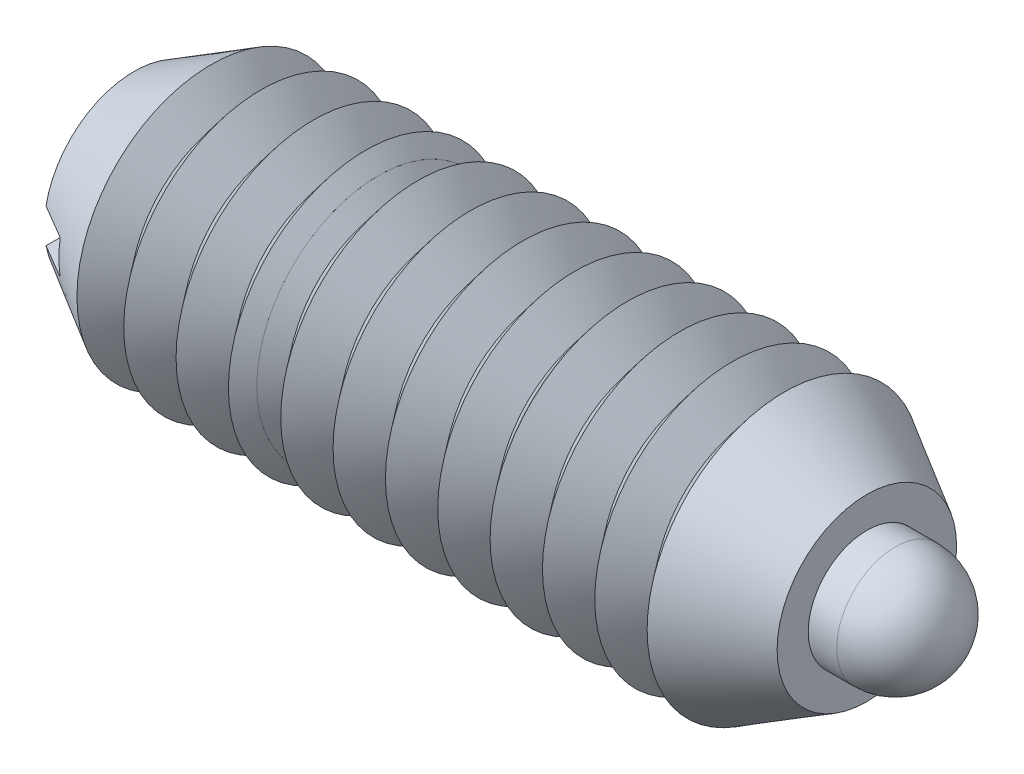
ISO-10303-21;
HEADER;
FILE_DESCRIPTION(('STEP AP214'),'2;1');
FILE_NAME('part.step','',(''),(''),'','','');
FILE_SCHEMA(('AUTOMOTIVE_DESIGN { 1 0 10303 214 1 1 1 1 }'));
ENDSEC;
DATA;
#1=APPLICATION_CONTEXT('core data for automotive mechanical design processes');
#2=APPLICATION_PROTOCOL_DEFINITION('international standard','automotive_design',2000,#1);
#3=PRODUCT_CONTEXT('',#1,'mechanical');
#4=PRODUCT('Part','Part','',(#3));
#5=PRODUCT_RELATED_PRODUCT_CATEGORY('part','',(#4));
#6=PRODUCT_DEFINITION_FORMATION('','',#4);
#7=PRODUCT_DEFINITION_CONTEXT('part definition',#1,'design');
#8=PRODUCT_DEFINITION('design','',#6,#7);
#9=PRODUCT_DEFINITION_SHAPE('','',#8);
#10=(LENGTH_UNIT() NAMED_UNIT(*) SI_UNIT(.MILLI.,.METRE.));
#11=(NAMED_UNIT(*) PLANE_ANGLE_UNIT() SI_UNIT($,.RADIAN.));
#12=(NAMED_UNIT(*) SI_UNIT($,.STERADIAN.) SOLID_ANGLE_UNIT());
#13=UNCERTAINTY_MEASURE_WITH_UNIT(LENGTH_MEASURE(1.E-05),#10,'distance_accuracy_value','');
#14=(GEOMETRIC_REPRESENTATION_CONTEXT(3) GLOBAL_UNCERTAINTY_ASSIGNED_CONTEXT((#13)) GLOBAL_UNIT_ASSIGNED_CONTEXT((#10,
#11,#12)) REPRESENTATION_CONTEXT('',''));
#15=CARTESIAN_POINT('',(0.,0.,0.));
#16=DIRECTION('',(0.,0.,1.));
#17=DIRECTION('',(1.,0.,0.));
#18=AXIS2_PLACEMENT_3D('',#15,#16,#17);
#19=CARTESIAN_POINT('',(9.0678,0.,0.));
#20=DIRECTION('',(-1.,0.,0.));
#21=DIRECTION('',(0.,-0.719424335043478,-0.694570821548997));
#22=AXIS2_PLACEMENT_3D('',#19,#20,#21);
#23=PLANE('',#22);
#24=CARTESIAN_POINT('',(9.0678,0.,0.));
#25=DIRECTION('',(1.,0.,0.));
#26=DIRECTION('',(0.,0.719424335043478,0.694570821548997));
#27=AXIS2_PLACEMENT_3D('',#24,#25,#26);
#28=CIRCLE('',#27,0.889);
#29=CARTESIAN_POINT('',(9.0678,0.639568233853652,0.617473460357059));
#30=VERTEX_POINT('',#29);
#31=EDGE_CURVE('P0_E10',#30,#30,#28,.T.);
#32=ORIENTED_EDGE('',*,*,#31,.F.);
#33=EDGE_LOOP('',(#32));
#34=FACE_BOUND('',#33,.T.);
#35=ADVANCED_FACE('P0_F14',(#34),#23,.T.);
#36=CARTESIAN_POINT('',(9.2456,0.,0.));
#37=DIRECTION('',(1.,0.,0.));
#38=DIRECTION('',(0.,0.719424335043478,0.694570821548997));
#39=AXIS2_PLACEMENT_3D('',#36,#37,#38);
#40=CONICAL_SURFACE('',#39,1.0668,0.78539816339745);
#41=ORIENTED_EDGE('',*,*,#31,.T.);
#42=EDGE_LOOP('',(#41));
#43=FACE_BOUND('',#42,.T.);
#44=CARTESIAN_POINT('',(9.2456,0.,0.));
#45=DIRECTION('',(1.,0.,0.));
#46=DIRECTION('',(0.,0.719424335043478,0.694570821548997));
#47=AXIS2_PLACEMENT_3D('',#44,#45,#46);
#48=CIRCLE('',#47,1.0668);
#49=CARTESIAN_POINT('',(9.2456,0.767481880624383,0.740968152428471));
#50=VERTEX_POINT('',#49);
#51=EDGE_CURVE('P0_E20',#50,#50,#48,.T.);
#52=ORIENTED_EDGE('',*,*,#51,.F.);
#53=EDGE_LOOP('',(#52));
#54=FACE_BOUND('',#53,.T.);
#55=ADVANCED_FACE('P0_F54',(#43,#54),#40,.T.);
#56=CARTESIAN_POINT('',(12.4333,0.,0.));
#57=DIRECTION('',(1.,0.,0.));
#58=DIRECTION('',(0.,0.719424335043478,0.694570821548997));
#59=AXIS2_PLACEMENT_3D('',#56,#57,#58);
#60=CYLINDRICAL_SURFACE('',#59,1.0668);
#61=ORIENTED_EDGE('',*,*,#51,.T.);
#62=EDGE_LOOP('',(#61));
#63=FACE_BOUND('',#62,.T.);
#64=CARTESIAN_POINT('',(10.5378413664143,0.,0.));
#65=DIRECTION('',(1.,0.,0.));
#66=DIRECTION('',(0.,0.719424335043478,0.694570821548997));
#67=AXIS2_PLACEMENT_3D('',#64,#65,#66);
#68=CIRCLE('',#67,1.0668);
#69=CARTESIAN_POINT('',(10.5378413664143,0.767481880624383,0.74096815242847));
#70=VERTEX_POINT('',#69);
#71=EDGE_CURVE('P0_E24',#70,#70,#68,.T.);
#72=ORIENTED_EDGE('',*,*,#71,.F.);
#73=EDGE_LOOP('',(#72));
#74=FACE_BOUND('',#73,.T.);
#75=ADVANCED_FACE('P0_F50',(#63,#74),#60,.T.);
#76=CARTESIAN_POINT('',(10.8458,0.,0.));
#77=DIRECTION('',(-1.,0.,0.));
#78=DIRECTION('',(0.,-0.719424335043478,-0.694570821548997));
#79=AXIS2_PLACEMENT_3D('',#76,#77,#78);
#80=CONICAL_SURFACE('',#79,0.889,0.523598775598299);
#81=ORIENTED_EDGE('',*,*,#71,.T.);
#82=EDGE_LOOP('',(#81));
#83=FACE_BOUND('',#82,.T.);
#84=CARTESIAN_POINT('',(10.8458,0.,0.));
#85=DIRECTION('',(1.,0.,0.));
#86=DIRECTION('',(0.,0.719424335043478,0.694570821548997));
#87=AXIS2_PLACEMENT_3D('',#84,#85,#86);
#88=CIRCLE('',#87,0.889);
#89=CARTESIAN_POINT('',(10.8458,0.639568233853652,0.617473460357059));
#90=VERTEX_POINT('',#89);
#91=EDGE_CURVE('P0_E28',#90,#90,#88,.T.);
#92=ORIENTED_EDGE('',*,*,#91,.F.);
#93=EDGE_LOOP('',(#92));
#94=FACE_BOUND('',#93,.T.);
#95=ADVANCED_FACE('P0_F41',(#83,#94),#80,.T.);
#96=CARTESIAN_POINT('',(12.4333,0.,0.));
#97=DIRECTION('',(1.,0.,0.));
#98=DIRECTION('',(0.,0.719424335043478,0.694570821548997));
#99=AXIS2_PLACEMENT_3D('',#96,#97,#98);
#100=CYLINDRICAL_SURFACE('',#99,0.889);
#101=ORIENTED_EDGE('',*,*,#91,.T.);
#102=EDGE_LOOP('',(#101));
#103=FACE_BOUND('',#102,.T.);
#104=CARTESIAN_POINT('',(11.5443,0.,0.));
#105=DIRECTION('',(1.,0.,0.));
#106=DIRECTION('',(0.,0.719424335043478,0.694570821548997));
#107=AXIS2_PLACEMENT_3D('',#104,#105,#106);
#108=CIRCLE('',#107,0.889);
#109=CARTESIAN_POINT('',(11.5443,0.639568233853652,0.617473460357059));
#110=VERTEX_POINT('',#109);
#111=EDGE_CURVE('P0_E33',#110,#110,#108,.T.);
#112=ORIENTED_EDGE('',*,*,#111,.F.);
#113=EDGE_LOOP('',(#112));
#114=FACE_BOUND('',#113,.T.);
#115=ADVANCED_FACE('P0_F39',(#103,#114),#100,.T.);
#116=CARTESIAN_POINT('',(11.5443,0.,0.));
#117=DIRECTION('',(1.,0.,0.));
#118=DIRECTION('',(0.,-0.719424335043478,-0.694570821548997));
#119=AXIS2_PLACEMENT_3D('',#116,#117,#118);
#120=SPHERICAL_SURFACE('',#119,0.889);
#121=ORIENTED_EDGE('',*,*,#111,.T.);
#122=EDGE_LOOP('',(#121));
#123=FACE_BOUND('',#122,.T.);
#124=ADVANCED_FACE('P0_F37',(#123),#120,.T.);
#125=CLOSED_SHELL('',(#35,#55,#75,#95,#115,#124));
#126=MANIFOLD_SOLID_BREP('P0_B1',#125);
#127=CARTESIAN_POINT('',(3.70416666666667,4.1656,-2.0828));
#128=DIRECTION('',(-1.,0.,0.));
#129=DIRECTION('',(0.,-1.,0.));
#130=AXIS2_PLACEMENT_3D('',#127,#128,#129);
#131=PLANE('',#130);
#132=CARTESIAN_POINT('',(3.70416666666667,0.,0.));
#133=DIRECTION('',(-1.,0.,0.));
#134=DIRECTION('',(0.,-1.,0.));
#135=AXIS2_PLACEMENT_3D('',#132,#133,#134);
#136=CIRCLE('',#135,1.84380808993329);
#137=CARTESIAN_POINT('',(3.70416666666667,-1.84380808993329,0.));
#138=VERTEX_POINT('',#137);
#139=EDGE_CURVE('P1_E31',#138,#138,#136,.F.);
#140=ORIENTED_EDGE('',*,*,#139,.F.);
#141=EDGE_LOOP('',(#140));
#142=FACE_BOUND('',#141,.T.);
#143=CARTESIAN_POINT('',(3.70416666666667,0.,0.));
#144=DIRECTION('',(1.,0.,0.));
#145=DIRECTION('',(0.,0.,-1.));
#146=AXIS2_PLACEMENT_3D('',#143,#144,#145);
#147=CIRCLE('',#146,1.0922);
#148=CARTESIAN_POINT('',(3.70416666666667,0.,-1.0922));
#149=VERTEX_POINT('',#148);
#150=EDGE_CURVE('P1_E47',#149,#149,#147,.T.);
#151=ORIENTED_EDGE('',*,*,#150,.T.);
#152=EDGE_LOOP('',(#151));
#153=FACE_BOUND('',#152,.T.);
#154=ADVANCED_FACE('P1_F14',(#142,#153),#131,.T.);
#155=CARTESIAN_POINT('',(7.40833333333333,4.1656,-2.0828));
#156=DIRECTION('',(1.,0.,0.));
#157=DIRECTION('',(0.,1.,0.));
#158=AXIS2_PLACEMENT_3D('',#155,#156,#157);
#159=PLANE('',#158);
#160=CARTESIAN_POINT('',(7.40833333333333,0.,0.));
#161=DIRECTION('',(1.,0.,0.));
#162=DIRECTION('',(0.,1.,0.));
#163=AXIS2_PLACEMENT_3D('',#160,#161,#162);
#164=CIRCLE('',#163,1.99132743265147);
#165=CARTESIAN_POINT('',(7.40833333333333,1.99132743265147,0.));
#166=VERTEX_POINT('',#165);
#167=EDGE_CURVE('P1_E33',#166,#166,#164,.F.);
#168=ORIENTED_EDGE('',*,*,#167,.F.);
#169=EDGE_LOOP('',(#168));
#170=FACE_BOUND('',#169,.T.);
#171=CARTESIAN_POINT('',(7.40833333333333,0.,0.));
#172=DIRECTION('',(1.,0.,0.));
#173=DIRECTION('',(0.,1.,0.));
#174=AXIS2_PLACEMENT_3D('',#171,#172,#173);
#175=CIRCLE('',#174,1.0922);
#176=CARTESIAN_POINT('',(7.40833333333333,1.0922,0.));
#177=VERTEX_POINT('',#176);
#178=EDGE_CURVE('P1_E18',#177,#177,#175,.F.);
#179=ORIENTED_EDGE('',*,*,#178,.T.);
#180=EDGE_LOOP('',(#179));
#181=FACE_BOUND('',#180,.T.);
#182=ADVANCED_FACE('P1_F77',(#170,#181),#159,.T.);
#183=CARTESIAN_POINT('',(5.10031999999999,0.,0.));
#184=DIRECTION('',(-1.,0.,0.));
#185=DIRECTION('',(0.,0.,1.));
#186=AXIS2_PLACEMENT_3D('',#183,#184,#185);
#187=CONICAL_SURFACE('',#186,2.0828,0.895664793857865);
#188=CARTESIAN_POINT('',(5.49719499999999,0.,0.));
#189=DIRECTION('',(-1.,0.,0.));
#190=DIRECTION('',(0.,0.,1.));
#191=AXIS2_PLACEMENT_3D('',#188,#189,#190);
#192=CIRCLE('',#191,1.58710328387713);
#193=CARTESIAN_POINT('',(5.49719499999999,0.,1.58710328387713));
#194=VERTEX_POINT('',#193);
#195=EDGE_CURVE('P1_E57',#194,#194,#192,.T.);
#196=ORIENTED_EDGE('',*,*,#195,.T.);
#197=EDGE_LOOP('',(#196));
#198=FACE_BOUND('',#197,.T.);
#199=CARTESIAN_POINT('',(5.10031999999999,0.,0.));
#200=DIRECTION('',(-1.,0.,0.));
#201=DIRECTION('',(0.,0.,1.));
#202=AXIS2_PLACEMENT_3D('',#199,#200,#201);
#203=CIRCLE('',#202,2.0828);
#204=CARTESIAN_POINT('',(5.10031999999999,0.,2.0828));
#205=VERTEX_POINT('',#204);
#206=EDGE_CURVE('P1_E44',#205,#205,#203,.T.);
#207=ORIENTED_EDGE('',*,*,#206,.F.);
#208=EDGE_LOOP('',(#207));
#209=FACE_BOUND('',#208,.T.);
#210=ADVANCED_FACE('P1_F83',(#198,#209),#187,.T.);
#211=CARTESIAN_POINT('',(4.70344499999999,0.,0.));
#212=DIRECTION('',(1.,0.,0.));
#213=DIRECTION('',(0.,0.,-1.));
#214=AXIS2_PLACEMENT_3D('',#211,#212,#213);
#215=CONICAL_SURFACE('',#214,1.58710328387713,0.895664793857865);
#216=ORIENTED_EDGE('',*,*,#206,.T.);
#217=EDGE_LOOP('',(#216));
#218=FACE_BOUND('',#217,.T.);
#219=CARTESIAN_POINT('',(4.70344499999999,0.,0.));
#220=DIRECTION('',(-1.,0.,0.));
#221=DIRECTION('',(0.,0.,1.));
#222=AXIS2_PLACEMENT_3D('',#219,#220,#221);
#223=CIRCLE('',#222,1.58710328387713);
#224=CARTESIAN_POINT('',(4.70344499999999,0.,1.58710328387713));
#225=VERTEX_POINT('',#224);
#226=EDGE_CURVE('P1_E51',#225,#225,#223,.T.);
#227=ORIENTED_EDGE('',*,*,#226,.F.);
#228=EDGE_LOOP('',(#227));
#229=FACE_BOUND('',#228,.T.);
#230=ADVANCED_FACE('P1_F101',(#218,#229),#215,.T.);
#231=CARTESIAN_POINT('',(4.30657,0.,0.));
#232=DIRECTION('',(-1.,0.,0.));
#233=DIRECTION('',(0.,0.,1.));
#234=AXIS2_PLACEMENT_3D('',#231,#232,#233);
#235=CONICAL_SURFACE('',#234,2.0828,0.895664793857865);
#236=ORIENTED_EDGE('',*,*,#226,.T.);
#237=EDGE_LOOP('',(#236));
#238=FACE_BOUND('',#237,.T.);
#239=CARTESIAN_POINT('',(4.30656999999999,0.,0.));
#240=DIRECTION('',(-1.,0.,0.));
#241=DIRECTION('',(0.,0.,1.));
#242=AXIS2_PLACEMENT_3D('',#239,#240,#241);
#243=CIRCLE('',#242,2.0828);
#244=CARTESIAN_POINT('',(4.30656999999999,0.,2.0828));
#245=VERTEX_POINT('',#244);
#246=EDGE_CURVE('P1_E35',#245,#245,#243,.T.);
#247=ORIENTED_EDGE('',*,*,#246,.F.);
#248=EDGE_LOOP('',(#247));
#249=FACE_BOUND('',#248,.T.);
#250=ADVANCED_FACE('P1_F98',(#238,#249),#235,.T.);
#251=CARTESIAN_POINT('',(3.909695,0.,0.));
#252=DIRECTION('',(1.,0.,0.));
#253=DIRECTION('',(0.,0.,-1.));
#254=AXIS2_PLACEMENT_3D('',#251,#252,#253);
#255=CONICAL_SURFACE('',#254,1.58710328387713,0.895664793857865);
#256=ORIENTED_EDGE('',*,*,#246,.T.);
#257=EDGE_LOOP('',(#256));
#258=FACE_BOUND('',#257,.T.);
#259=CARTESIAN_POINT('',(3.909695,0.,0.));
#260=DIRECTION('',(-1.,0.,0.));
#261=DIRECTION('',(0.,0.,1.));
#262=AXIS2_PLACEMENT_3D('',#259,#260,#261);
#263=CIRCLE('',#262,1.58710328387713);
#264=CARTESIAN_POINT('',(3.909695,0.,1.58710328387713));
#265=VERTEX_POINT('',#264);
#266=EDGE_CURVE('P1_E39',#265,#265,#263,.T.);
#267=ORIENTED_EDGE('',*,*,#266,.F.);
#268=EDGE_LOOP('',(#267));
#269=FACE_BOUND('',#268,.T.);
#270=ADVANCED_FACE('P1_F94',(#258,#269),#255,.T.);
#271=CARTESIAN_POINT('',(3.51282,0.,0.));
#272=DIRECTION('',(-1.,0.,0.));
#273=DIRECTION('',(0.,0.,1.));
#274=AXIS2_PLACEMENT_3D('',#271,#272,#273);
#275=CONICAL_SURFACE('',#274,2.0828,0.895664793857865);
#276=ORIENTED_EDGE('',*,*,#266,.T.);
#277=EDGE_LOOP('',(#276));
#278=FACE_BOUND('',#277,.T.);
#279=ORIENTED_EDGE('',*,*,#139,.T.);
#280=EDGE_LOOP('',(#279));
#281=FACE_BOUND('',#280,.T.);
#282=ADVANCED_FACE('P1_F90',(#278,#281),#275,.T.);
#283=CARTESIAN_POINT('',(5.49719499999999,0.,0.));
#284=DIRECTION('',(1.,0.,0.));
#285=DIRECTION('',(0.,0.,-1.));
#286=AXIS2_PLACEMENT_3D('',#283,#284,#285);
#287=CONICAL_SURFACE('',#286,1.58710328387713,0.895664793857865);
#288=CARTESIAN_POINT('',(5.89406999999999,0.,0.));
#289=DIRECTION('',(-1.,0.,0.));
#290=DIRECTION('',(0.,0.,1.));
#291=AXIS2_PLACEMENT_3D('',#288,#289,#290);
#292=CIRCLE('',#291,2.0828);
#293=CARTESIAN_POINT('',(5.89406999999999,0.,2.0828));
#294=VERTEX_POINT('',#293);
#295=EDGE_CURVE('P1_E54',#294,#294,#292,.T.);
#296=ORIENTED_EDGE('',*,*,#295,.T.);
#297=EDGE_LOOP('',(#296));
#298=FACE_BOUND('',#297,.T.);
#299=ORIENTED_EDGE('',*,*,#195,.F.);
#300=EDGE_LOOP('',(#299));
#301=FACE_BOUND('',#300,.T.);
#302=ADVANCED_FACE('P1_F93',(#298,#301),#287,.T.);
#303=CARTESIAN_POINT('',(5.89406999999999,0.,0.));
#304=DIRECTION('',(-1.,0.,0.));
#305=DIRECTION('',(0.,0.,1.));
#306=AXIS2_PLACEMENT_3D('',#303,#304,#305);
#307=CONICAL_SURFACE('',#306,2.0828,0.895664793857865);
#308=CARTESIAN_POINT('',(6.29094499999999,0.,0.));
#309=DIRECTION('',(-1.,0.,0.));
#310=DIRECTION('',(0.,0.,1.));
#311=AXIS2_PLACEMENT_3D('',#308,#309,#310);
#312=CIRCLE('',#311,1.58710328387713);
#313=CARTESIAN_POINT('',(6.29094499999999,0.,1.58710328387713));
#314=VERTEX_POINT('',#313);
#315=EDGE_CURVE('P1_E22',#314,#314,#312,.T.);
#316=ORIENTED_EDGE('',*,*,#315,.T.);
#317=EDGE_LOOP('',(#316));
#318=FACE_BOUND('',#317,.T.);
#319=ORIENTED_EDGE('',*,*,#295,.F.);
#320=EDGE_LOOP('',(#319));
#321=FACE_BOUND('',#320,.T.);
#322=ADVANCED_FACE('P1_F74',(#318,#321),#307,.T.);
#323=CARTESIAN_POINT('',(6.29094499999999,0.,0.));
#324=DIRECTION('',(1.,0.,0.));
#325=DIRECTION('',(0.,0.,-1.));
#326=AXIS2_PLACEMENT_3D('',#323,#324,#325);
#327=CONICAL_SURFACE('',#326,1.58710328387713,0.895664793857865);
#328=CARTESIAN_POINT('',(6.68781999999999,0.,0.));
#329=DIRECTION('',(-1.,0.,0.));
#330=DIRECTION('',(0.,0.,1.));
#331=AXIS2_PLACEMENT_3D('',#328,#329,#330);
#332=CIRCLE('',#331,2.0828);
#333=CARTESIAN_POINT('',(6.68781999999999,0.,2.0828));
#334=VERTEX_POINT('',#333);
#335=EDGE_CURVE('P1_E27',#334,#334,#332,.T.);
#336=ORIENTED_EDGE('',*,*,#335,.T.);
#337=EDGE_LOOP('',(#336));
#338=FACE_BOUND('',#337,.T.);
#339=ORIENTED_EDGE('',*,*,#315,.F.);
#340=EDGE_LOOP('',(#339));
#341=FACE_BOUND('',#340,.T.);
#342=ADVANCED_FACE('P1_F62',(#338,#341),#327,.T.);
#343=CARTESIAN_POINT('',(6.68781999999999,0.,0.));
#344=DIRECTION('',(-1.,0.,0.));
#345=DIRECTION('',(0.,0.,1.));
#346=AXIS2_PLACEMENT_3D('',#343,#344,#345);
#347=CONICAL_SURFACE('',#346,2.0828,0.895664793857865);
#348=CARTESIAN_POINT('',(7.08469499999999,0.,0.));
#349=DIRECTION('',(-1.,0.,0.));
#350=DIRECTION('',(0.,0.,1.));
#351=AXIS2_PLACEMENT_3D('',#348,#349,#350);
#352=CIRCLE('',#351,1.58710328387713);
#353=CARTESIAN_POINT('',(7.08469499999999,0.,1.58710328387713));
#354=VERTEX_POINT('',#353);
#355=EDGE_CURVE('P1_E10',#354,#354,#352,.T.);
#356=ORIENTED_EDGE('',*,*,#355,.T.);
#357=EDGE_LOOP('',(#356));
#358=FACE_BOUND('',#357,.T.);
#359=ORIENTED_EDGE('',*,*,#335,.F.);
#360=EDGE_LOOP('',(#359));
#361=FACE_BOUND('',#360,.T.);
#362=ADVANCED_FACE('P1_F65',(#358,#361),#347,.T.);
#363=CARTESIAN_POINT('',(7.08469499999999,0.,0.));
#364=DIRECTION('',(1.,0.,0.));
#365=DIRECTION('',(0.,0.,-1.));
#366=AXIS2_PLACEMENT_3D('',#363,#364,#365);
#367=CONICAL_SURFACE('',#366,1.58710328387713,0.895664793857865);
#368=ORIENTED_EDGE('',*,*,#355,.F.);
#369=EDGE_LOOP('',(#368));
#370=FACE_BOUND('',#369,.T.);
#371=ORIENTED_EDGE('',*,*,#167,.T.);
#372=EDGE_LOOP('',(#371));
#373=FACE_BOUND('',#372,.T.);
#374=ADVANCED_FACE('P1_F16',(#370,#373),#367,.T.);
#375=CARTESIAN_POINT('',(11.1125,0.,0.));
#376=DIRECTION('',(-1.,0.,0.));
#377=DIRECTION('',(0.,0.,1.));
#378=AXIS2_PLACEMENT_3D('',#375,#376,#377);
#379=CYLINDRICAL_SURFACE('',#378,1.0922);
#380=ORIENTED_EDGE('',*,*,#178,.F.);
#381=EDGE_LOOP('',(#380));
#382=FACE_BOUND('',#381,.T.);
#383=ORIENTED_EDGE('',*,*,#150,.F.);
#384=EDGE_LOOP('',(#383));
#385=FACE_BOUND('',#384,.T.);
#386=ADVANCED_FACE('P1_F72',(#382,#385),#379,.F.);
#387=CLOSED_SHELL('',(#154,#182,#210,#230,#250,#270,#282,#302,#322,#342,#362,#374,#386));
#388=MANIFOLD_SOLID_BREP('P1_B1',#387);
#389=CARTESIAN_POINT('',(11.1125,0.,0.));
#390=DIRECTION('',(1.,0.,0.));
#391=DIRECTION('',(0.,0.,-1.));
#392=AXIS2_PLACEMENT_3D('',#389,#390,#391);
#393=PLANE('',#392);
#394=CARTESIAN_POINT('',(11.1125,0.,0.));
#395=DIRECTION('',(1.,0.,0.));
#396=DIRECTION('',(0.,0.,-1.));
#397=AXIS2_PLACEMENT_3D('',#394,#395,#396);
#398=CIRCLE('',#397,1.36129691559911);
#399=CARTESIAN_POINT('',(11.1125,0.,-1.36129691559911));
#400=VERTEX_POINT('',#399);
#401=EDGE_CURVE('P2_E79',#400,#400,#398,.T.);
#402=ORIENTED_EDGE('',*,*,#401,.T.);
#403=EDGE_LOOP('',(#402));
#404=FACE_BOUND('',#403,.T.);
#405=CARTESIAN_POINT('',(11.1125,0.,0.));
#406=DIRECTION('',(-1.,0.,0.));
#407=DIRECTION('',(0.,0.,1.));
#408=AXIS2_PLACEMENT_3D('',#405,#406,#407);
#409=CIRCLE('',#408,0.889);
#410=CARTESIAN_POINT('',(11.1125,0.,0.889));
#411=VERTEX_POINT('',#410);
#412=EDGE_CURVE('P2_E66',#411,#411,#409,.T.);
#413=ORIENTED_EDGE('',*,*,#412,.T.);
#414=EDGE_LOOP('',(#413));
#415=FACE_BOUND('',#414,.T.);
#416=ADVANCED_FACE('P2_F15',(#404,#415),#393,.T.);
#417=CARTESIAN_POINT('',(11.1125,0.,0.));
#418=DIRECTION('',(-1.,0.,0.));
#419=DIRECTION('',(0.,0.,1.));
#420=AXIS2_PLACEMENT_3D('',#417,#418,#419);
#421=CONICAL_SURFACE('',#420,1.36129691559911,0.523598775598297);
#422=CARTESIAN_POINT('',(9.86281999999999,0.,0.));
#423=DIRECTION('',(-1.,0.,0.));
#424=DIRECTION('',(0.,0.,1.));
#425=AXIS2_PLACEMENT_3D('',#422,#423,#424);
#426=CIRCLE('',#425,2.0828);
#427=CARTESIAN_POINT('',(9.86281999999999,0.,2.0828));
#428=VERTEX_POINT('',#427);
#429=EDGE_CURVE('P2_E159',#428,#428,#426,.T.);
#430=ORIENTED_EDGE('',*,*,#429,.F.);
#431=EDGE_LOOP('',(#430));
#432=FACE_BOUND('',#431,.T.);
#433=ORIENTED_EDGE('',*,*,#401,.F.);
#434=EDGE_LOOP('',(#433));
#435=FACE_BOUND('',#434,.T.);
#436=ADVANCED_FACE('P2_F17',(#432,#435),#421,.T.);
#437=CARTESIAN_POINT('',(0.,0.,0.));
#438=DIRECTION('',(-1.,0.,0.));
#439=DIRECTION('',(0.,0.,1.));
#440=AXIS2_PLACEMENT_3D('',#437,#438,#439);
#441=CYLINDRICAL_SURFACE('',#440,0.889);
#442=CARTESIAN_POINT('',(10.8458,0.,0.));
#443=DIRECTION('',(-1.,0.,0.));
#444=DIRECTION('',(0.,0.,1.));
#445=AXIS2_PLACEMENT_3D('',#442,#443,#444);
#446=CIRCLE('',#445,0.889);
#447=CARTESIAN_POINT('',(10.8458,0.,0.889));
#448=VERTEX_POINT('',#447);
#449=EDGE_CURVE('P2_E171',#448,#448,#446,.T.);
#450=ORIENTED_EDGE('',*,*,#449,.T.);
#451=EDGE_LOOP('',(#450));
#452=FACE_BOUND('',#451,.T.);
#453=ORIENTED_EDGE('',*,*,#412,.F.);
#454=EDGE_LOOP('',(#453));
#455=FACE_BOUND('',#454,.T.);
#456=ADVANCED_FACE('P2_F194',(#452,#455),#441,.F.);
#457=CARTESIAN_POINT('',(10.8458,0.,0.));
#458=DIRECTION('',(-1.,0.,0.));
#459=DIRECTION('',(0.,0.,1.));
#460=AXIS2_PLACEMENT_3D('',#457,#458,#459);
#461=CONICAL_SURFACE('',#460,0.889,0.78539816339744);
#462=CARTESIAN_POINT('',(10.668,0.,0.));
#463=DIRECTION('',(-1.,0.,0.));
#464=DIRECTION('',(0.,0.,1.));
#465=AXIS2_PLACEMENT_3D('',#462,#463,#464);
#466=CIRCLE('',#465,1.0668);
#467=CARTESIAN_POINT('',(10.668,0.,1.0668));
#468=VERTEX_POINT('',#467);
#469=EDGE_CURVE('P2_E168',#468,#468,#466,.T.);
#470=ORIENTED_EDGE('',*,*,#469,.T.);
#471=EDGE_LOOP('',(#470));
#472=FACE_BOUND('',#471,.T.);
#473=ORIENTED_EDGE('',*,*,#449,.F.);
#474=EDGE_LOOP('',(#473));
#475=FACE_BOUND('',#474,.T.);
#476=ADVANCED_FACE('P2_F201',(#472,#475),#461,.F.);
#477=CARTESIAN_POINT('',(0.,0.,0.));
#478=DIRECTION('',(-1.,0.,0.));
#479=DIRECTION('',(0.,0.,1.));
#480=AXIS2_PLACEMENT_3D('',#477,#478,#479);
#481=CYLINDRICAL_SURFACE('',#480,1.0668);
#482=CARTESIAN_POINT('',(1.5621,0.,0.));
#483=DIRECTION('',(-1.,0.,0.));
#484=DIRECTION('',(0.,0.,1.));
#485=AXIS2_PLACEMENT_3D('',#482,#483,#484);
#486=CIRCLE('',#485,1.0668);
#487=CARTESIAN_POINT('',(1.5621,0.,1.0668));
#488=VERTEX_POINT('',#487);
#489=EDGE_CURVE('P2_E165',#488,#488,#486,.T.);
#490=ORIENTED_EDGE('',*,*,#489,.T.);
#491=EDGE_LOOP('',(#490));
#492=FACE_BOUND('',#491,.T.);
#493=ORIENTED_EDGE('',*,*,#469,.F.);
#494=EDGE_LOOP('',(#493));
#495=FACE_BOUND('',#494,.T.);
#496=ADVANCED_FACE('P2_F206',(#492,#495),#481,.F.);
#497=CARTESIAN_POINT('',(1.5621,0.,0.));
#498=DIRECTION('',(1.,0.,0.));
#499=DIRECTION('',(0.,0.,-1.));
#500=AXIS2_PLACEMENT_3D('',#497,#498,#499);
#501=PLANE('',#500);
#502=ORIENTED_EDGE('',*,*,#489,.F.);
#503=EDGE_LOOP('',(#502));
#504=FACE_BOUND('',#503,.T.);
#505=ADVANCED_FACE('P2_F212',(#504),#501,.T.);
#506=CARTESIAN_POINT('',(9.46594499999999,0.,0.));
#507=DIRECTION('',(1.,0.,0.));
#508=DIRECTION('',(0.,0.,-1.));
#509=AXIS2_PLACEMENT_3D('',#506,#507,#508);
#510=CONICAL_SURFACE('',#509,1.58710328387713,0.895664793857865);
#511=ORIENTED_EDGE('',*,*,#429,.T.);
#512=EDGE_LOOP('',(#511));
#513=FACE_BOUND('',#512,.T.);
#514=CARTESIAN_POINT('',(9.46594499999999,0.,0.));
#515=DIRECTION('',(-1.,0.,0.));
#516=DIRECTION('',(0.,0.,1.));
#517=AXIS2_PLACEMENT_3D('',#514,#515,#516);
#518=CIRCLE('',#517,1.58710328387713);
#519=CARTESIAN_POINT('',(9.46594499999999,0.,1.58710328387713));
#520=VERTEX_POINT('',#519);
#521=EDGE_CURVE('P2_E162',#520,#520,#518,.T.);
#522=ORIENTED_EDGE('',*,*,#521,.F.);
#523=EDGE_LOOP('',(#522));
#524=FACE_BOUND('',#523,.T.);
#525=ADVANCED_FACE('P2_F216',(#513,#524),#510,.T.);
#526=CARTESIAN_POINT('',(9.06906999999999,0.,0.));
#527=DIRECTION('',(-1.,0.,0.));
#528=DIRECTION('',(0.,0.,1.));
#529=AXIS2_PLACEMENT_3D('',#526,#527,#528);
#530=CONICAL_SURFACE('',#529,2.0828,0.895664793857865);
#531=ORIENTED_EDGE('',*,*,#521,.T.);
#532=EDGE_LOOP('',(#531));
#533=FACE_BOUND('',#532,.T.);
#534=CARTESIAN_POINT('',(9.06906999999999,0.,0.));
#535=DIRECTION('',(-1.,0.,0.));
#536=DIRECTION('',(0.,0.,1.));
#537=AXIS2_PLACEMENT_3D('',#534,#535,#536);
#538=CIRCLE('',#537,2.0828);
#539=CARTESIAN_POINT('',(9.06906999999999,0.,2.0828));
#540=VERTEX_POINT('',#539);
#541=EDGE_CURVE('P2_E153',#540,#540,#538,.T.);
#542=ORIENTED_EDGE('',*,*,#541,.F.);
#543=EDGE_LOOP('',(#542));
#544=FACE_BOUND('',#543,.T.);
#545=ADVANCED_FACE('P2_F220',(#533,#544),#530,.T.);
#546=CARTESIAN_POINT('',(8.67219499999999,0.,0.));
#547=DIRECTION('',(1.,0.,0.));
#548=DIRECTION('',(0.,0.,-1.));
#549=AXIS2_PLACEMENT_3D('',#546,#547,#548);
#550=CONICAL_SURFACE('',#549,1.58710328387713,0.895664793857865);
#551=ORIENTED_EDGE('',*,*,#541,.T.);
#552=EDGE_LOOP('',(#551));
#553=FACE_BOUND('',#552,.T.);
#554=CARTESIAN_POINT('',(8.67219499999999,0.,0.));
#555=DIRECTION('',(-1.,0.,0.));
#556=DIRECTION('',(0.,0.,1.));
#557=AXIS2_PLACEMENT_3D('',#554,#555,#556);
#558=CIRCLE('',#557,1.58710328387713);
#559=CARTESIAN_POINT('',(8.67219499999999,0.,1.58710328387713));
#560=VERTEX_POINT('',#559);
#561=EDGE_CURVE('P2_E156',#560,#560,#558,.T.);
#562=ORIENTED_EDGE('',*,*,#561,.F.);
#563=EDGE_LOOP('',(#562));
#564=FACE_BOUND('',#563,.T.);
#565=ADVANCED_FACE('P2_F224',(#553,#564),#550,.T.);
#566=CARTESIAN_POINT('',(8.27532,0.,0.));
#567=DIRECTION('',(-1.,0.,0.));
#568=DIRECTION('',(0.,0.,1.));
#569=AXIS2_PLACEMENT_3D('',#566,#567,#568);
#570=CONICAL_SURFACE('',#569,2.0828,0.895664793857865);
#571=ORIENTED_EDGE('',*,*,#561,.T.);
#572=EDGE_LOOP('',(#571));
#573=FACE_BOUND('',#572,.T.);
#574=CARTESIAN_POINT('',(8.27531999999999,0.,0.));
#575=DIRECTION('',(-1.,0.,0.));
#576=DIRECTION('',(0.,0.,1.));
#577=AXIS2_PLACEMENT_3D('',#574,#575,#576);
#578=CIRCLE('',#577,2.0828);
#579=CARTESIAN_POINT('',(8.27531999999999,0.,2.0828));
#580=VERTEX_POINT('',#579);
#581=EDGE_CURVE('P2_E147',#580,#580,#578,.T.);
#582=ORIENTED_EDGE('',*,*,#581,.F.);
#583=EDGE_LOOP('',(#582));
#584=FACE_BOUND('',#583,.T.);
#585=ADVANCED_FACE('P2_F228',(#573,#584),#570,.T.);
#586=CARTESIAN_POINT('',(7.87844499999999,0.,0.));
#587=DIRECTION('',(1.,0.,0.));
#588=DIRECTION('',(0.,0.,-1.));
#589=AXIS2_PLACEMENT_3D('',#586,#587,#588);
#590=CONICAL_SURFACE('',#589,1.58710328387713,0.895664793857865);
#591=ORIENTED_EDGE('',*,*,#581,.T.);
#592=EDGE_LOOP('',(#591));
#593=FACE_BOUND('',#592,.T.);
#594=CARTESIAN_POINT('',(7.87844499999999,0.,0.));
#595=DIRECTION('',(-1.,0.,0.));
#596=DIRECTION('',(0.,0.,1.));
#597=AXIS2_PLACEMENT_3D('',#594,#595,#596);
#598=CIRCLE('',#597,1.58710328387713);
#599=CARTESIAN_POINT('',(7.87844499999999,0.,1.58710328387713));
#600=VERTEX_POINT('',#599);
#601=EDGE_CURVE('P2_E150',#600,#600,#598,.T.);
#602=ORIENTED_EDGE('',*,*,#601,.F.);
#603=EDGE_LOOP('',(#602));
#604=FACE_BOUND('',#603,.T.);
#605=ADVANCED_FACE('P2_F232',(#593,#604),#590,.T.);
#606=CARTESIAN_POINT('',(7.48156999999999,0.,0.));
#607=DIRECTION('',(-1.,0.,0.));
#608=DIRECTION('',(0.,0.,1.));
#609=AXIS2_PLACEMENT_3D('',#606,#607,#608);
#610=CONICAL_SURFACE('',#609,2.0828,0.895664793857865);
#611=ORIENTED_EDGE('',*,*,#601,.T.);
#612=EDGE_LOOP('',(#611));
#613=FACE_BOUND('',#612,.T.);
#614=CARTESIAN_POINT('',(7.48156999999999,0.,0.));
#615=DIRECTION('',(-1.,0.,0.));
#616=DIRECTION('',(0.,0.,1.));
#617=AXIS2_PLACEMENT_3D('',#614,#615,#616);
#618=CIRCLE('',#617,2.0828);
#619=CARTESIAN_POINT('',(7.48156999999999,0.,2.0828));
#620=VERTEX_POINT('',#619);
#621=EDGE_CURVE('P2_E144',#620,#620,#618,.T.);
#622=ORIENTED_EDGE('',*,*,#621,.F.);
#623=EDGE_LOOP('',(#622));
#624=FACE_BOUND('',#623,.T.);
#625=ADVANCED_FACE('P2_F236',(#613,#624),#610,.T.);
#626=CARTESIAN_POINT('',(7.08469499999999,0.,0.));
#627=DIRECTION('',(1.,0.,0.));
#628=DIRECTION('',(0.,0.,-1.));
#629=AXIS2_PLACEMENT_3D('',#626,#627,#628);
#630=CONICAL_SURFACE('',#629,1.58710328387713,0.895664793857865);
#631=CARTESIAN_POINT('',(7.40833333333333,0.,0.));
#632=DIRECTION('',(1.,0.,0.));
#633=DIRECTION('',(0.,0.,-1.));
#634=AXIS2_PLACEMENT_3D('',#631,#632,#633);
#635=CIRCLE('',#634,1.99132743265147);
#636=CARTESIAN_POINT('',(7.40833333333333,0.,-1.99132743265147));
#637=VERTEX_POINT('',#636);
#638=EDGE_CURVE('P2_E19',#637,#637,#635,.F.);
#639=ORIENTED_EDGE('',*,*,#638,.F.);
#640=EDGE_LOOP('',(#639));
#641=FACE_BOUND('',#640,.T.);
#642=ORIENTED_EDGE('',*,*,#621,.T.);
#643=EDGE_LOOP('',(#642));
#644=FACE_BOUND('',#643,.T.);
#645=ADVANCED_FACE('P2_F240',(#641,#644),#630,.T.);
#646=CARTESIAN_POINT('',(3.70416666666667,0.,0.));
#647=DIRECTION('',(1.,0.,0.));
#648=DIRECTION('',(0.,0.,-1.));
#649=AXIS2_PLACEMENT_3D('',#646,#647,#648);
#650=PLANE('',#649);
#651=CARTESIAN_POINT('',(3.70416666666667,0.,0.));
#652=DIRECTION('',(1.,0.,0.));
#653=DIRECTION('',(0.,0.,-1.));
#654=AXIS2_PLACEMENT_3D('',#651,#652,#653);
#655=CIRCLE('',#654,1.84380808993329);
#656=CARTESIAN_POINT('',(3.70416666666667,0.,-1.84380808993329));
#657=VERTEX_POINT('',#656);
#658=EDGE_CURVE('P2_E114',#657,#657,#655,.F.);
#659=ORIENTED_EDGE('',*,*,#658,.F.);
#660=EDGE_LOOP('',(#659));
#661=FACE_BOUND('',#660,.T.);
#662=CARTESIAN_POINT('',(3.70416666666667,0.,0.));
#663=DIRECTION('',(1.,0.,0.));
#664=DIRECTION('',(0.,0.,-1.));
#665=AXIS2_PLACEMENT_3D('',#662,#663,#664);
#666=CIRCLE('',#665,1.0922);
#667=CARTESIAN_POINT('',(3.70416666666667,0.,-1.0922));
#668=VERTEX_POINT('',#667);
#669=EDGE_CURVE('P2_E116',#668,#668,#666,.T.);
#670=ORIENTED_EDGE('',*,*,#669,.F.);
#671=EDGE_LOOP('',(#670));
#672=FACE_BOUND('',#671,.T.);
#673=ADVANCED_FACE('P2_F244',(#661,#672),#650,.T.);
#674=CARTESIAN_POINT('',(13.440802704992,0.,0.));
#675=DIRECTION('',(-1.,0.,0.));
#676=DIRECTION('',(0.,0.,1.));
#677=AXIS2_PLACEMENT_3D('',#674,#675,#676);
#678=CYLINDRICAL_SURFACE('',#677,1.0922);
#679=ORIENTED_EDGE('',*,*,#669,.T.);
#680=EDGE_LOOP('',(#679));
#681=FACE_BOUND('',#680,.T.);
#682=CARTESIAN_POINT('',(7.40833333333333,0.,0.));
#683=DIRECTION('',(1.,0.,0.));
#684=DIRECTION('',(0.,0.,-1.));
#685=AXIS2_PLACEMENT_3D('',#682,#683,#684);
#686=CIRCLE('',#685,1.0922);
#687=CARTESIAN_POINT('',(7.40833333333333,0.,-1.0922));
#688=VERTEX_POINT('',#687);
#689=EDGE_CURVE('P2_E122',#688,#688,#686,.T.);
#690=ORIENTED_EDGE('',*,*,#689,.F.);
#691=EDGE_LOOP('',(#690));
#692=FACE_BOUND('',#691,.T.);
#693=ADVANCED_FACE('P2_F185',(#681,#692),#678,.T.);
#694=CARTESIAN_POINT('',(7.40833333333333,0.,0.));
#695=DIRECTION('',(1.,0.,0.));
#696=DIRECTION('',(0.,0.,-1.));
#697=AXIS2_PLACEMENT_3D('',#694,#695,#696);
#698=PLANE('',#697);
#699=ORIENTED_EDGE('',*,*,#638,.T.);
#700=EDGE_LOOP('',(#699));
#701=FACE_BOUND('',#700,.T.);
#702=ORIENTED_EDGE('',*,*,#689,.T.);
#703=EDGE_LOOP('',(#702));
#704=FACE_BOUND('',#703,.T.);
#705=ADVANCED_FACE('P2_F180',(#701,#704),#698,.F.);
#706=CARTESIAN_POINT('',(0.,0.,0.));
#707=DIRECTION('',(1.,0.,0.));
#708=DIRECTION('',(0.,0.,-1.));
#709=AXIS2_PLACEMENT_3D('',#706,#707,#708);
#710=PLANE('',#709);
#711=CARTESIAN_POINT('',(0.,0.,0.));
#712=DIRECTION('',(1.,0.,0.));
#713=DIRECTION('',(0.,0.,-1.));
#714=AXIS2_PLACEMENT_3D('',#711,#712,#713);
#715=CIRCLE('',#714,1.36129691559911);
#716=CARTESIAN_POINT('',(0.,-0.26035,-1.33616884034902));
#717=VERTEX_POINT('',#716);
#718=CARTESIAN_POINT('',(0.,-0.26035,1.33616884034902));
#719=VERTEX_POINT('',#718);
#720=EDGE_CURVE('P2_E75',#717,#719,#715,.F.);
#721=ORIENTED_EDGE('',*,*,#720,.T.);
#722=DIRECTION('',(0.,0.,1.));
#723=VECTOR('',#722,1.);
#724=CARTESIAN_POINT('',(0.,-0.26035,-2.0828));
#725=LINE('',#724,#723);
#726=EDGE_CURVE('P2_E33',#717,#719,#725,.T.);
#727=ORIENTED_EDGE('',*,*,#726,.F.);
#728=EDGE_LOOP('',(#721,#727));
#729=FACE_BOUND('',#728,.T.);
#730=ADVANCED_FACE('P2_F101',(#729),#710,.F.);
#731=CARTESIAN_POINT('',(0.,-0.26035,-2.0828));
#732=DIRECTION('',(0.,-1.,0.));
#733=DIRECTION('',(0.,0.,-1.));
#734=AXIS2_PLACEMENT_3D('',#731,#732,#733);
#735=PLANE('',#734);
#736=CARTESIAN_POINT('',(3.03971056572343,-0.26035,-3.10538007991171));
#737=CARTESIAN_POINT('',(2.73619356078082,-0.26035,-2.9295030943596));
#738=CARTESIAN_POINT('',(2.43269972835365,-0.26035,-2.75358610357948));
#739=CARTESIAN_POINT('',(1.82581746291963,-0.26035,-2.40143298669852));
#740=CARTESIAN_POINT('',(1.52242906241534,-0.26035,-2.22519680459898));
#741=CARTESIAN_POINT('',(0.923841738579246,-0.26035,-1.87683600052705));
#742=CARTESIAN_POINT('',(0.628635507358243,-0.26035,-1.70472396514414));
#743=CARTESIAN_POINT('',(0.186359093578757,-0.26035,-1.44570325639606));
#744=CARTESIAN_POINT('',(0.0390349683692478,-0.26035,-1.35922831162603));
#745=CARTESIAN_POINT('',(-0.255316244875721,-0.26035,-1.18577470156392));
#746=CARTESIAN_POINT('',(-0.402343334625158,-0.26035,-1.0987960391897));
#747=CARTESIAN_POINT('',(-0.622839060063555,-0.26035,-0.967335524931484));
#748=CARTESIAN_POINT('',(-0.696530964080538,-0.26035,-0.923228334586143));
#749=CARTESIAN_POINT('',(-0.843706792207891,-0.26035,-0.834610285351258));
#750=CARTESIAN_POINT('',(-0.91719063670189,-0.26035,-0.790099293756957));
#751=CARTESIAN_POINT('',(-1.06453357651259,-0.26035,-0.699987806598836));
#752=CARTESIAN_POINT('',(-1.13838868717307,-0.26035,-0.654380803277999));
#753=CARTESIAN_POINT('',(-1.28534608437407,-0.26035,-0.562114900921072));
#754=CARTESIAN_POINT('',(-1.35844905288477,-0.26035,-0.51545710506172));
#755=CARTESIAN_POINT('',(-1.46699058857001,-0.26035,-0.44371439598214));
#756=CARTESIAN_POINT('',(-1.50300072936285,-0.26035,-0.419496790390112));
#757=CARTESIAN_POINT('',(-1.57449047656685,-0.26035,-0.370070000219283));
#758=CARTESIAN_POINT('',(-1.60996835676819,-0.26035,-0.344858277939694));
#759=CARTESIAN_POINT('',(-1.66212735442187,-0.26035,-0.305972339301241));
#760=CARTESIAN_POINT('',(-1.67925518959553,-0.26035,-0.292899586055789));
#761=CARTESIAN_POINT('',(-1.71308292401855,-0.26035,-0.266214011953));
#762=CARTESIAN_POINT('',(-1.72978291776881,-0.26035,-0.252601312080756));
#763=CARTESIAN_POINT('',(-1.76246737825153,-0.26035,-0.224673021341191));
#764=CARTESIAN_POINT('',(-1.77845456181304,-0.26035,-0.210360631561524));
#765=CARTESIAN_POINT('',(-1.8093682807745,-0.26035,-0.180644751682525));
#766=CARTESIAN_POINT('',(-1.82429647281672,-0.26035,-0.165243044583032));
#767=CARTESIAN_POINT('',(-1.84830527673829,-0.26035,-0.137332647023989));
#768=CARTESIAN_POINT('',(-1.85784954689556,-0.26035,-0.12522888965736));
#769=CARTESIAN_POINT('',(-1.87526950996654,-0.26035,-0.0998803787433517));
#770=CARTESIAN_POINT('',(-1.88315152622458,-0.26035,-0.0866402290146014));
#771=CARTESIAN_POINT('',(-1.89362009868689,-0.26035,-0.0641663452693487));
#772=CARTESIAN_POINT('',(-1.89707777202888,-0.26035,-0.0553472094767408));
#773=CARTESIAN_POINT('',(-1.90255870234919,-0.26035,-0.0372693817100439));
#774=CARTESIAN_POINT('',(-1.90458387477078,-0.26035,-0.0280112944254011));
#775=CARTESIAN_POINT('',(-1.90690933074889,-0.26035,-0.0091896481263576));
#776=CARTESIAN_POINT('',(-1.90719465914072,-0.26035,0.000375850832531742));
#777=CARTESIAN_POINT('',(-1.90594810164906,-0.26035,0.0193849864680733));
#778=CARTESIAN_POINT('',(-1.904415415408,-0.26035,0.0288285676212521));
#779=CARTESIAN_POINT('',(-1.89930080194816,-0.26035,0.0492465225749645));
#780=CARTESIAN_POINT('',(-1.89535686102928,-0.26035,0.0601271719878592));
#781=CARTESIAN_POINT('',(-1.88583002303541,-0.26035,0.0811465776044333));
#782=CARTESIAN_POINT('',(-1.88024216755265,-0.26035,0.0912829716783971));
#783=CARTESIAN_POINT('',(-1.86616017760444,-0.26035,0.113752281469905));
#784=CARTESIAN_POINT('',(-1.85729534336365,-0.26035,0.12584751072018));
#785=CARTESIAN_POINT('',(-1.83844868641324,-0.26035,0.14914656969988));
#786=CARTESIAN_POINT('',(-1.8284644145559,-0.26035,0.160348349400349));
#787=CARTESIAN_POINT('',(-1.80771838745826,-0.26035,0.182146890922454));
#788=CARTESIAN_POINT('',(-1.79695173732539,-0.26035,0.192738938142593));
#789=CARTESIAN_POINT('',(-1.77494825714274,-0.26035,0.213391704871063));
#790=CARTESIAN_POINT('',(-1.76371196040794,-0.26035,0.223452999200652));
#791=CARTESIAN_POINT('',(-1.72699655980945,-0.26035,0.255225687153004));
#792=CARTESIAN_POINT('',(-1.70086338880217,-0.26035,0.276176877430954));
#793=CARTESIAN_POINT('',(-1.64774249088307,-0.26035,0.316973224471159));
#794=CARTESIAN_POINT('',(-1.6207542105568,-0.26035,0.336817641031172));
#795=CARTESIAN_POINT('',(-1.56621112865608,-0.26035,0.375819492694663));
#796=CARTESIAN_POINT('',(-1.53865536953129,-0.26035,0.394975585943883));
#797=CARTESIAN_POINT('',(-1.48320590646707,-0.26035,0.43279358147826));
#798=CARTESIAN_POINT('',(-1.45531217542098,-0.26035,0.451455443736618));
#799=CARTESIAN_POINT('',(-1.37141571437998,-0.26035,0.506836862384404));
#800=CARTESIAN_POINT('',(-1.3150724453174,-0.26035,0.543039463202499));
#801=CARTESIAN_POINT('',(-1.20196774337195,-0.26035,0.614629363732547));
#802=CARTESIAN_POINT('',(-1.14520688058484,-0.26035,0.650017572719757));
#803=CARTESIAN_POINT('',(-0.975156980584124,-0.26035,0.755060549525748));
#804=CARTESIAN_POINT('',(-0.861438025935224,-0.26035,0.824018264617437));
#805=CARTESIAN_POINT('',(-0.633489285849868,-0.26035,0.961087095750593));
#806=CARTESIAN_POINT('',(-0.51925948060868,-0.26035,1.02919817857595));
#807=CARTESIAN_POINT('',(-0.290453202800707,-0.26035,1.16497012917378));
#808=CARTESIAN_POINT('',(-0.175876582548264,-0.26035,1.23263074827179));
#809=CARTESIAN_POINT('',(0.0534476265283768,-0.26035,1.36765677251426));
#810=CARTESIAN_POINT('',(0.168195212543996,-0.26035,1.43502218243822));
#811=CARTESIAN_POINT('',(0.512461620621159,-0.26035,1.63675212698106));
#812=CARTESIAN_POINT('',(0.742145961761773,-0.26035,1.77083413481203));
#813=CARTESIAN_POINT('',(1.20169275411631,-0.26035,2.03861386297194));
#814=CARTESIAN_POINT('',(1.43155517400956,-0.26035,2.17231163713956));
#815=CARTESIAN_POINT('',(1.77626909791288,-0.26035,2.37259626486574));
#816=CARTESIAN_POINT('',(1.89107369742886,-0.26035,2.43926383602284));
#817=CARTESIAN_POINT('',(2.12071173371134,-0.26035,2.57255910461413));
#818=CARTESIAN_POINT('',(2.23554517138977,-0.26035,2.63918680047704));
#819=CARTESIAN_POINT('',(2.46526042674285,-0.26035,2.77242550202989));
#820=CARTESIAN_POINT('',(2.58014224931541,-0.26035,2.83903649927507));
#821=CARTESIAN_POINT('',(2.80991750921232,-0.26035,2.97222858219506));
#822=CARTESIAN_POINT('',(2.92481094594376,-0.26035,3.03880966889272));
#823=CARTESIAN_POINT('',(3.03971056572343,-0.26035,3.10538007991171));
#824=B_SPLINE_CURVE_WITH_KNOTS('',3,(#736,#737,#738,#739,#740,#741,#742,#743,#744,#745,#746,
#747,#748,#749,#750,#751,#752,#753,#754,#755,#756,#757,#758,#759,#760,#761,#762,#763,#764,#765,
#766,#767,#768,#769,#770,#771,#772,#773,#774,#775,#776,#777,#778,#779,#780,#781,#782,#783,#784,
#785,#786,#787,#788,#789,#790,#791,#792,#793,#794,#795,#796,#797,#798,#799,#800,#801,#802,#803,
#804,#805,#806,#807,#808,#809,#810,#811,#812,#813,#814,#815,#816,#817,#818,#819,#820,#821,#822,
#823),.UNSPECIFIED.,.F.,.F.,(4,2,2,2,2,2,2,2,2,2,2,2,2,2,2,2,2,2,2,2,2,2,2,2,2,2,2,2,2,2,2,2,2,
2,2,2,2,2,2,2,2,2,2,4),(0.,1.05237703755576,2.10496120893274,3.13010514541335,3.64258983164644,
4.15507155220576,4.41272093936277,4.67045831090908,4.93086252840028,5.19100504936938,
5.32118736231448,5.45172676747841,5.51635986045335,5.58097855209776,5.64532514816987,
5.7095687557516,5.75574056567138,5.80173343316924,5.83005964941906,5.85834791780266,
5.88687900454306,5.91542265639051,5.9499455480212,5.98457365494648,6.02944937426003,
6.07442526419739,6.11971188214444,6.1649484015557,6.26536678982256,6.36585155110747,
6.46652260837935,6.56720179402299,6.76810239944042,6.96876659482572,7.3677344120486,
7.76671783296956,8.16590577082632,8.5650872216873,9.3629558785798,10.16070667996,
10.5589803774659,10.9572688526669,11.3556577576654,11.7540318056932),.UNSPECIFIED.);
#825=CARTESIAN_POINT('',(0.5207,-0.26035,-1.64140385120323));
#826=VERTEX_POINT('',#825);
#827=EDGE_CURVE('P2_E92',#826,#717,#824,.T.);
#828=ORIENTED_EDGE('',*,*,#827,.T.);
#829=ORIENTED_EDGE('',*,*,#726,.T.);
#830=CARTESIAN_POINT('',(0.5207,-0.26035,1.64140385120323));
#831=VERTEX_POINT('',#830);
#832=EDGE_CURVE('P2_E86',#719,#831,#824,.T.);
#833=ORIENTED_EDGE('',*,*,#832,.T.);
#834=DIRECTION('',(0.,0.,1.));
#835=VECTOR('',#834,1.);
#836=CARTESIAN_POINT('',(0.5207,-0.26035,-2.0828));
#837=LINE('',#836,#835);
#838=EDGE_CURVE('P2_E80',#826,#831,#837,.T.);
#839=ORIENTED_EDGE('',*,*,#838,.F.);
#840=EDGE_LOOP('',(#828,#829,#833,#839));
#841=FACE_BOUND('',#840,.T.);
#842=ADVANCED_FACE('P2_F95',(#841),#735,.F.);
#843=CARTESIAN_POINT('',(0.5207,0.26035,-2.0828));
#844=DIRECTION('',(1.,0.,0.));
#845=DIRECTION('',(0.,0.,-1.));
#846=AXIS2_PLACEMENT_3D('',#843,#844,#845);
#847=PLANE('',#846);
#848=CARTESIAN_POINT('',(0.5207,0.,0.));
#849=DIRECTION('',(1.,0.,0.));
#850=DIRECTION('',(0.,0.,-1.));
#851=AXIS2_PLACEMENT_3D('',#848,#849,#850);
#852=CIRCLE('',#851,1.66192320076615);
#853=CARTESIAN_POINT('',(0.5207,0.26035,1.64140385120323));
#854=VERTEX_POINT('',#853);
#855=EDGE_CURVE('P2_E41',#831,#854,#852,.F.);
#856=ORIENTED_EDGE('',*,*,#855,.T.);
#857=DIRECTION('',(0.,0.,1.));
#858=VECTOR('',#857,1.);
#859=CARTESIAN_POINT('',(0.5207,0.26035,-2.0828));
#860=LINE('',#859,#858);
#861=CARTESIAN_POINT('',(0.5207,0.26035,-1.64140385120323));
#862=VERTEX_POINT('',#861);
#863=EDGE_CURVE('P2_E76',#862,#854,#860,.T.);
#864=ORIENTED_EDGE('',*,*,#863,.F.);
#865=EDGE_CURVE('P2_E24',#862,#826,#852,.F.);
#866=ORIENTED_EDGE('',*,*,#865,.T.);
#867=ORIENTED_EDGE('',*,*,#838,.T.);
#868=EDGE_LOOP('',(#856,#864,#866,#867));
#869=FACE_BOUND('',#868,.T.);
#870=ADVANCED_FACE('P2_F100',(#869),#847,.F.);
#871=CARTESIAN_POINT('',(0.,0.26035,1.33616884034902));
#872=VERTEX_POINT('',#871);
#873=CARTESIAN_POINT('',(0.,0.26035,-1.33616884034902));
#874=VERTEX_POINT('',#873);
#875=EDGE_CURVE('P2_E72',#872,#874,#715,.F.);
#876=ORIENTED_EDGE('',*,*,#875,.T.);
#877=DIRECTION('',(0.,0.,1.));
#878=VECTOR('',#877,1.);
#879=CARTESIAN_POINT('',(0.,0.26035,-2.0828));
#880=LINE('',#879,#878);
#881=EDGE_CURVE('P2_E59',#874,#872,#880,.T.);
#882=ORIENTED_EDGE('',*,*,#881,.T.);
#883=EDGE_LOOP('',(#876,#882));
#884=FACE_BOUND('',#883,.T.);
#885=ADVANCED_FACE('P2_F74',(#884),#710,.F.);
#886=CARTESIAN_POINT('',(0.,0.26035,-2.0828));
#887=DIRECTION('',(0.,1.,0.));
#888=DIRECTION('',(0.,0.,1.));
#889=AXIS2_PLACEMENT_3D('',#886,#887,#888);
#890=PLANE('',#889);
#891=CARTESIAN_POINT('',(3.03971056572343,0.26035,3.10538007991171));
#892=CARTESIAN_POINT('',(2.73619356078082,0.26035,2.9295030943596));
#893=CARTESIAN_POINT('',(2.43269972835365,0.26035,2.75358610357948));
#894=CARTESIAN_POINT('',(1.82581746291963,0.26035,2.40143298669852));
#895=CARTESIAN_POINT('',(1.52242906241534,0.26035,2.22519680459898));
#896=CARTESIAN_POINT('',(0.923841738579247,0.26035,1.87683600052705));
#897=CARTESIAN_POINT('',(0.628635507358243,0.26035,1.70472396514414));
#898=CARTESIAN_POINT('',(0.186359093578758,0.26035,1.44570325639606));
#899=CARTESIAN_POINT('',(0.0390349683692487,0.26035,1.35922831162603));
#900=CARTESIAN_POINT('',(-0.25531624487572,0.26035,1.18577470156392));
#901=CARTESIAN_POINT('',(-0.402343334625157,0.26035,1.0987960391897));
#902=CARTESIAN_POINT('',(-0.622839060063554,0.26035,0.967335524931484));
#903=CARTESIAN_POINT('',(-0.696530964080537,0.26035,0.923228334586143));
#904=CARTESIAN_POINT('',(-0.84370679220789,0.26035,0.834610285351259));
#905=CARTESIAN_POINT('',(-0.917190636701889,0.26035,0.790099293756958));
#906=CARTESIAN_POINT('',(-1.06453357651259,0.26035,0.699987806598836));
#907=CARTESIAN_POINT('',(-1.13838868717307,0.26035,0.654380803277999));
#908=CARTESIAN_POINT('',(-1.28534608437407,0.26035,0.562114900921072));
#909=CARTESIAN_POINT('',(-1.35844905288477,0.26035,0.51545710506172));
#910=CARTESIAN_POINT('',(-1.46699058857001,0.26035,0.44371439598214));
#911=CARTESIAN_POINT('',(-1.50300072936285,0.26035,0.419496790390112));
#912=CARTESIAN_POINT('',(-1.57449047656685,0.26035,0.370070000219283));
#913=CARTESIAN_POINT('',(-1.60996835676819,0.26035,0.344858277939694));
#914=CARTESIAN_POINT('',(-1.66212735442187,0.26035,0.305972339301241));
#915=CARTESIAN_POINT('',(-1.67925518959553,0.26035,0.292899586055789));
#916=CARTESIAN_POINT('',(-1.71308292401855,0.26035,0.266214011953));
#917=CARTESIAN_POINT('',(-1.72978291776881,0.26035,0.252601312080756));
#918=CARTESIAN_POINT('',(-1.76246737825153,0.26035,0.22467302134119));
#919=CARTESIAN_POINT('',(-1.77845456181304,0.26035,0.210360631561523));
#920=CARTESIAN_POINT('',(-1.8093682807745,0.26035,0.180644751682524));
#921=CARTESIAN_POINT('',(-1.82429647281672,0.26035,0.165243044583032));
#922=CARTESIAN_POINT('',(-1.84830527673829,0.26035,0.137332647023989));
#923=CARTESIAN_POINT('',(-1.85784954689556,0.26035,0.12522888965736));
#924=CARTESIAN_POINT('',(-1.87526950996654,0.26035,0.0998803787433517));
#925=CARTESIAN_POINT('',(-1.88315152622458,0.26035,0.0866402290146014));
#926=CARTESIAN_POINT('',(-1.89362009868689,0.26035,0.0641663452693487));
#927=CARTESIAN_POINT('',(-1.89707777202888,0.26035,0.0553472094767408));
#928=CARTESIAN_POINT('',(-1.90255870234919,0.26035,0.0372693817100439));
#929=CARTESIAN_POINT('',(-1.90458387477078,0.26035,0.0280112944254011));
#930=CARTESIAN_POINT('',(-1.90690933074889,0.26035,0.0091896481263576));
#931=CARTESIAN_POINT('',(-1.90719465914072,0.26035,-0.000375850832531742));
#932=CARTESIAN_POINT('',(-1.90594810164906,0.26035,-0.0193849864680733));
#933=CARTESIAN_POINT('',(-1.904415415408,0.26035,-0.0288285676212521));
#934=CARTESIAN_POINT('',(-1.89930080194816,0.26035,-0.0492465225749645));
#935=CARTESIAN_POINT('',(-1.89535686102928,0.26035,-0.0601271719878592));
#936=CARTESIAN_POINT('',(-1.88583002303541,0.26035,-0.0811465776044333));
#937=CARTESIAN_POINT('',(-1.88024216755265,0.26035,-0.0912829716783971));
#938=CARTESIAN_POINT('',(-1.86616017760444,0.26035,-0.113752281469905));
#939=CARTESIAN_POINT('',(-1.85729534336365,0.26035,-0.12584751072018));
#940=CARTESIAN_POINT('',(-1.83844868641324,0.26035,-0.14914656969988));
#941=CARTESIAN_POINT('',(-1.8284644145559,0.26035,-0.160348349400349));
#942=CARTESIAN_POINT('',(-1.80771838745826,0.26035,-0.182146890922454));
#943=CARTESIAN_POINT('',(-1.79695173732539,0.26035,-0.192738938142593));
#944=CARTESIAN_POINT('',(-1.77494825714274,0.26035,-0.213391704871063));
#945=CARTESIAN_POINT('',(-1.76371196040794,0.26035,-0.223452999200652));
#946=CARTESIAN_POINT('',(-1.72699655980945,0.26035,-0.255225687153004));
#947=CARTESIAN_POINT('',(-1.70086338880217,0.26035,-0.276176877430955));
#948=CARTESIAN_POINT('',(-1.64774249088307,0.26035,-0.316973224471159));
#949=CARTESIAN_POINT('',(-1.6207542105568,0.26035,-0.336817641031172));
#950=CARTESIAN_POINT('',(-1.56621112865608,0.26035,-0.375819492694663));
#951=CARTESIAN_POINT('',(-1.53865536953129,0.26035,-0.394975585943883));
#952=CARTESIAN_POINT('',(-1.48320590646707,0.26035,-0.43279358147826));
#953=CARTESIAN_POINT('',(-1.45531217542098,0.26035,-0.451455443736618));
#954=CARTESIAN_POINT('',(-1.37141571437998,0.26035,-0.506836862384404));
#955=CARTESIAN_POINT('',(-1.3150724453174,0.26035,-0.543039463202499));
#956=CARTESIAN_POINT('',(-1.20196774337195,0.26035,-0.614629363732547));
#957=CARTESIAN_POINT('',(-1.14520688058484,0.26035,-0.650017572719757));
#958=CARTESIAN_POINT('',(-0.975156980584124,0.26035,-0.755060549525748));
#959=CARTESIAN_POINT('',(-0.861438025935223,0.26035,-0.824018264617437));
#960=CARTESIAN_POINT('',(-0.633489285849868,0.26035,-0.961087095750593));
#961=CARTESIAN_POINT('',(-0.51925948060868,0.26035,-1.02919817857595));
#962=CARTESIAN_POINT('',(-0.290453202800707,0.26035,-1.16497012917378));
#963=CARTESIAN_POINT('',(-0.175876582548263,0.26035,-1.23263074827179));
#964=CARTESIAN_POINT('',(0.0534476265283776,0.26035,-1.36765677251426));
#965=CARTESIAN_POINT('',(0.168195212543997,0.26035,-1.43502218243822));
#966=CARTESIAN_POINT('',(0.512461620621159,0.26035,-1.63675212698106));
#967=CARTESIAN_POINT('',(0.742145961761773,0.26035,-1.77083413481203));
#968=CARTESIAN_POINT('',(1.20169275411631,0.26035,-2.03861386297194));
#969=CARTESIAN_POINT('',(1.43155517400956,0.26035,-2.17231163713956));
#970=CARTESIAN_POINT('',(1.77626909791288,0.26035,-2.37259626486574));
#971=CARTESIAN_POINT('',(1.89107369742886,0.26035,-2.43926383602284));
#972=CARTESIAN_POINT('',(2.12071173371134,0.26035,-2.57255910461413));
#973=CARTESIAN_POINT('',(2.23554517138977,0.26035,-2.63918680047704));
#974=CARTESIAN_POINT('',(2.46526042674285,0.26035,-2.77242550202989));
#975=CARTESIAN_POINT('',(2.58014224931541,0.26035,-2.83903649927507));
#976=CARTESIAN_POINT('',(2.80991750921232,0.26035,-2.97222858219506));
#977=CARTESIAN_POINT('',(2.92481094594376,0.26035,-3.03880966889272));
#978=CARTESIAN_POINT('',(3.03971056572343,0.26035,-3.10538007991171));
#979=B_SPLINE_CURVE_WITH_KNOTS('',3,(#891,#892,#893,#894,#895,#896,#897,#898,#899,#900,#901,
#902,#903,#904,#905,#906,#907,#908,#909,#910,#911,#912,#913,#914,#915,#916,#917,#918,#919,#920,
#921,#922,#923,#924,#925,#926,#927,#928,#929,#930,#931,#932,#933,#934,#935,#936,#937,#938,#939,
#940,#941,#942,#943,#944,#945,#946,#947,#948,#949,#950,#951,#952,#953,#954,#955,#956,#957,#958,
#959,#960,#961,#962,#963,#964,#965,#966,#967,#968,#969,#970,#971,#972,#973,#974,#975,#976,#977,
#978),.UNSPECIFIED.,.F.,.F.,(4,2,2,2,2,2,2,2,2,2,2,2,2,2,2,2,2,2,2,2,2,2,2,2,2,2,2,2,2,2,2,2,2,
2,2,2,2,2,2,2,2,2,2,4),(0.,1.05237703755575,2.10496120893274,3.13010514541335,3.64258983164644,
4.15507155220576,4.41272093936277,4.67045831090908,4.93086252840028,5.19100504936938,
5.32118736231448,5.45172676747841,5.51635986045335,5.58097855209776,5.64532514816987,
5.7095687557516,5.75574056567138,5.80173343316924,5.83005964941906,5.85834791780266,
5.88687900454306,5.91542265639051,5.9499455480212,5.98457365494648,6.02944937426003,
6.07442526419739,6.11971188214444,6.1649484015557,6.26536678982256,6.36585155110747,
6.46652260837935,6.56720179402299,6.76810239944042,6.96876659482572,7.3677344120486,
7.76671783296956,8.16590577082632,8.56508722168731,9.3629558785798,10.16070667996,
10.5589803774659,10.9572688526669,11.3556577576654,11.7540318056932),.UNSPECIFIED.);
#980=EDGE_CURVE('P2_E26',#854,#872,#979,.T.);
#981=ORIENTED_EDGE('',*,*,#980,.T.);
#982=ORIENTED_EDGE('',*,*,#881,.F.);
#983=EDGE_CURVE('P2_E10',#874,#862,#979,.T.);
#984=ORIENTED_EDGE('',*,*,#983,.T.);
#985=ORIENTED_EDGE('',*,*,#863,.T.);
#986=EDGE_LOOP('',(#981,#982,#984,#985));
#987=FACE_BOUND('',#986,.T.);
#988=ADVANCED_FACE('P2_F61',(#987),#890,.F.);
#989=CARTESIAN_POINT('',(1.24968,0.,0.));
#990=DIRECTION('',(1.,0.,0.));
#991=DIRECTION('',(0.,0.,-1.));
#992=AXIS2_PLACEMENT_3D('',#989,#990,#991);
#993=CONICAL_SURFACE('',#992,2.0828,0.523598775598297);
#994=ORIENTED_EDGE('',*,*,#983,.F.);
#995=ORIENTED_EDGE('',*,*,#875,.F.);
#996=ORIENTED_EDGE('',*,*,#980,.F.);
#997=ORIENTED_EDGE('',*,*,#855,.F.);
#998=ORIENTED_EDGE('',*,*,#832,.F.);
#999=ORIENTED_EDGE('',*,*,#720,.F.);
#1000=ORIENTED_EDGE('',*,*,#827,.F.);
#1001=ORIENTED_EDGE('',*,*,#865,.F.);
#1002=EDGE_LOOP('',(#994,#995,#996,#997,#998,#999,#1000,#1001));
#1003=FACE_BOUND('',#1002,.T.);
#1004=CARTESIAN_POINT('',(1.1689072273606,0.,0.));
#1005=DIRECTION('',(-1.,0.,0.));
#1006=DIRECTION('',(0.,0.,1.));
#1007=AXIS2_PLACEMENT_3D('',#1004,#1005,#1006);
#1008=CIRCLE('',#1007,2.03616581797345);
#1009=CARTESIAN_POINT('',(1.1689072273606,0.,2.03616581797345));
#1010=VERTEX_POINT('',#1009);
#1011=EDGE_CURVE('P2_E110',#1010,#1010,#1008,.T.);
#1012=ORIENTED_EDGE('',*,*,#1011,.T.);
#1013=EDGE_LOOP('',(#1012));
#1014=FACE_BOUND('',#1013,.T.);
#1015=ADVANCED_FACE('P2_F70',(#1003,#1014),#993,.T.);
#1016=CARTESIAN_POINT('',(1.13156999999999,0.,0.));
#1017=DIRECTION('',(-1.,0.,0.));
#1018=DIRECTION('',(0.,0.,1.));
#1019=AXIS2_PLACEMENT_3D('',#1016,#1017,#1018);
#1020=CONICAL_SURFACE('',#1019,2.0828,0.895664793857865);
#1021=ORIENTED_EDGE('',*,*,#1011,.F.);
#1022=EDGE_LOOP('',(#1021));
#1023=FACE_BOUND('',#1022,.T.);
#1024=CARTESIAN_POINT('',(1.52844499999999,0.,0.));
#1025=DIRECTION('',(-1.,0.,0.));
#1026=DIRECTION('',(0.,0.,1.));
#1027=AXIS2_PLACEMENT_3D('',#1024,#1025,#1026);
#1028=CIRCLE('',#1027,1.58710328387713);
#1029=CARTESIAN_POINT('',(1.52844499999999,0.,1.58710328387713));
#1030=VERTEX_POINT('',#1029);
#1031=EDGE_CURVE('P2_E113',#1030,#1030,#1028,.T.);
#1032=ORIENTED_EDGE('',*,*,#1031,.T.);
#1033=EDGE_LOOP('',(#1032));
#1034=FACE_BOUND('',#1033,.T.);
#1035=ADVANCED_FACE('P2_F269',(#1023,#1034),#1020,.T.);
#1036=CARTESIAN_POINT('',(1.52844499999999,0.,0.));
#1037=DIRECTION('',(1.,0.,0.));
#1038=DIRECTION('',(0.,0.,-1.));
#1039=AXIS2_PLACEMENT_3D('',#1036,#1037,#1038);
#1040=CONICAL_SURFACE('',#1039,1.58710328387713,0.895664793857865);
#1041=CARTESIAN_POINT('',(1.92531999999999,0.,0.));
#1042=DIRECTION('',(-1.,0.,0.));
#1043=DIRECTION('',(0.,0.,1.));
#1044=AXIS2_PLACEMENT_3D('',#1041,#1042,#1043);
#1045=CIRCLE('',#1044,2.0828);
#1046=CARTESIAN_POINT('',(1.92531999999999,0.,2.0828));
#1047=VERTEX_POINT('',#1046);
#1048=EDGE_CURVE('P2_E120',#1047,#1047,#1045,.T.);
#1049=ORIENTED_EDGE('',*,*,#1048,.T.);
#1050=EDGE_LOOP('',(#1049));
#1051=FACE_BOUND('',#1050,.T.);
#1052=ORIENTED_EDGE('',*,*,#1031,.F.);
#1053=EDGE_LOOP('',(#1052));
#1054=FACE_BOUND('',#1053,.T.);
#1055=ADVANCED_FACE('P2_F265',(#1051,#1054),#1040,.T.);
#1056=CARTESIAN_POINT('',(1.92532,0.,0.));
#1057=DIRECTION('',(-1.,0.,0.));
#1058=DIRECTION('',(0.,0.,1.));
#1059=AXIS2_PLACEMENT_3D('',#1056,#1057,#1058);
#1060=CONICAL_SURFACE('',#1059,2.0828,0.895664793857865);
#1061=CARTESIAN_POINT('',(2.32219499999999,0.,0.));
#1062=DIRECTION('',(-1.,0.,0.));
#1063=DIRECTION('',(0.,0.,1.));
#1064=AXIS2_PLACEMENT_3D('',#1061,#1062,#1063);
#1065=CIRCLE('',#1064,1.58710328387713);
#1066=CARTESIAN_POINT('',(2.32219499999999,0.,1.58710328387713));
#1067=VERTEX_POINT('',#1066);
#1068=EDGE_CURVE('P2_E135',#1067,#1067,#1065,.T.);
#1069=ORIENTED_EDGE('',*,*,#1068,.T.);
#1070=EDGE_LOOP('',(#1069));
#1071=FACE_BOUND('',#1070,.T.);
#1072=ORIENTED_EDGE('',*,*,#1048,.F.);
#1073=EDGE_LOOP('',(#1072));
#1074=FACE_BOUND('',#1073,.T.);
#1075=ADVANCED_FACE('P2_F261',(#1071,#1074),#1060,.T.);
#1076=CARTESIAN_POINT('',(2.32219499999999,0.,0.));
#1077=DIRECTION('',(1.,0.,0.));
#1078=DIRECTION('',(0.,0.,-1.));
#1079=AXIS2_PLACEMENT_3D('',#1076,#1077,#1078);
#1080=CONICAL_SURFACE('',#1079,1.58710328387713,0.895664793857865);
#1081=CARTESIAN_POINT('',(2.71906999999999,0.,0.));
#1082=DIRECTION('',(-1.,0.,0.));
#1083=DIRECTION('',(0.,0.,1.));
#1084=AXIS2_PLACEMENT_3D('',#1081,#1082,#1083);
#1085=CIRCLE('',#1084,2.0828);
#1086=CARTESIAN_POINT('',(2.71906999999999,0.,2.0828));
#1087=VERTEX_POINT('',#1086);
#1088=EDGE_CURVE('P2_E112',#1087,#1087,#1085,.T.);
#1089=ORIENTED_EDGE('',*,*,#1088,.T.);
#1090=EDGE_LOOP('',(#1089));
#1091=FACE_BOUND('',#1090,.T.);
#1092=ORIENTED_EDGE('',*,*,#1068,.F.);
#1093=EDGE_LOOP('',(#1092));
#1094=FACE_BOUND('',#1093,.T.);
#1095=ADVANCED_FACE('P2_F257',(#1091,#1094),#1080,.T.);
#1096=CARTESIAN_POINT('',(2.71907,0.,0.));
#1097=DIRECTION('',(-1.,0.,0.));
#1098=DIRECTION('',(0.,0.,1.));
#1099=AXIS2_PLACEMENT_3D('',#1096,#1097,#1098);
#1100=CONICAL_SURFACE('',#1099,2.0828,0.895664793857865);
#1101=CARTESIAN_POINT('',(3.115945,0.,0.));
#1102=DIRECTION('',(-1.,0.,0.));
#1103=DIRECTION('',(0.,0.,1.));
#1104=AXIS2_PLACEMENT_3D('',#1101,#1102,#1103);
#1105=CIRCLE('',#1104,1.58710328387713);
#1106=CARTESIAN_POINT('',(3.115945,0.,1.58710328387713));
#1107=VERTEX_POINT('',#1106);
#1108=EDGE_CURVE('P2_E141',#1107,#1107,#1105,.T.);
#1109=ORIENTED_EDGE('',*,*,#1108,.T.);
#1110=EDGE_LOOP('',(#1109));
#1111=FACE_BOUND('',#1110,.T.);
#1112=ORIENTED_EDGE('',*,*,#1088,.F.);
#1113=EDGE_LOOP('',(#1112));
#1114=FACE_BOUND('',#1113,.T.);
#1115=ADVANCED_FACE('P2_F253',(#1111,#1114),#1100,.T.);
#1116=CARTESIAN_POINT('',(3.115945,0.,0.));
#1117=DIRECTION('',(1.,0.,0.));
#1118=DIRECTION('',(0.,0.,-1.));
#1119=AXIS2_PLACEMENT_3D('',#1116,#1117,#1118);
#1120=CONICAL_SURFACE('',#1119,1.58710328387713,0.895664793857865);
#1121=CARTESIAN_POINT('',(3.51281999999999,0.,0.));
#1122=DIRECTION('',(-1.,0.,0.));
#1123=DIRECTION('',(0.,0.,1.));
#1124=AXIS2_PLACEMENT_3D('',#1121,#1122,#1123);
#1125=CIRCLE('',#1124,2.0828);
#1126=CARTESIAN_POINT('',(3.51281999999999,0.,2.0828));
#1127=VERTEX_POINT('',#1126);
#1128=EDGE_CURVE('P2_E138',#1127,#1127,#1125,.T.);
#1129=ORIENTED_EDGE('',*,*,#1128,.T.);
#1130=EDGE_LOOP('',(#1129));
#1131=FACE_BOUND('',#1130,.T.);
#1132=ORIENTED_EDGE('',*,*,#1108,.F.);
#1133=EDGE_LOOP('',(#1132));
#1134=FACE_BOUND('',#1133,.T.);
#1135=ADVANCED_FACE('P2_F249',(#1131,#1134),#1120,.T.);
#1136=CARTESIAN_POINT('',(3.51282,0.,0.));
#1137=DIRECTION('',(-1.,0.,0.));
#1138=DIRECTION('',(0.,0.,1.));
#1139=AXIS2_PLACEMENT_3D('',#1136,#1137,#1138);
#1140=CONICAL_SURFACE('',#1139,2.0828,0.895664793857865);
#1141=ORIENTED_EDGE('',*,*,#1128,.F.);
#1142=EDGE_LOOP('',(#1141));
#1143=FACE_BOUND('',#1142,.T.);
#1144=ORIENTED_EDGE('',*,*,#658,.T.);
#1145=EDGE_LOOP('',(#1144));
#1146=FACE_BOUND('',#1145,.T.);
#1147=ADVANCED_FACE('P2_F246',(#1143,#1146),#1140,.T.);
#1148=CLOSED_SHELL('',(#416,#436,#456,#476,#496,#505,#525,#545,#565,#585,#605,#625,#645,#673,
#693,#705,#730,#842,#870,#885,#988,#1015,#1035,#1055,#1075,#1095,#1115,#1135,#1147));
#1149=MANIFOLD_SOLID_BREP('P2_B1',#1148);
#1150=ADVANCED_BREP_SHAPE_REPRESENTATION('',(#18,#126,#388,#1149),#14);
#1151=SHAPE_DEFINITION_REPRESENTATION(#9,#1150);
ENDSEC;
END-ISO-10303-21;
